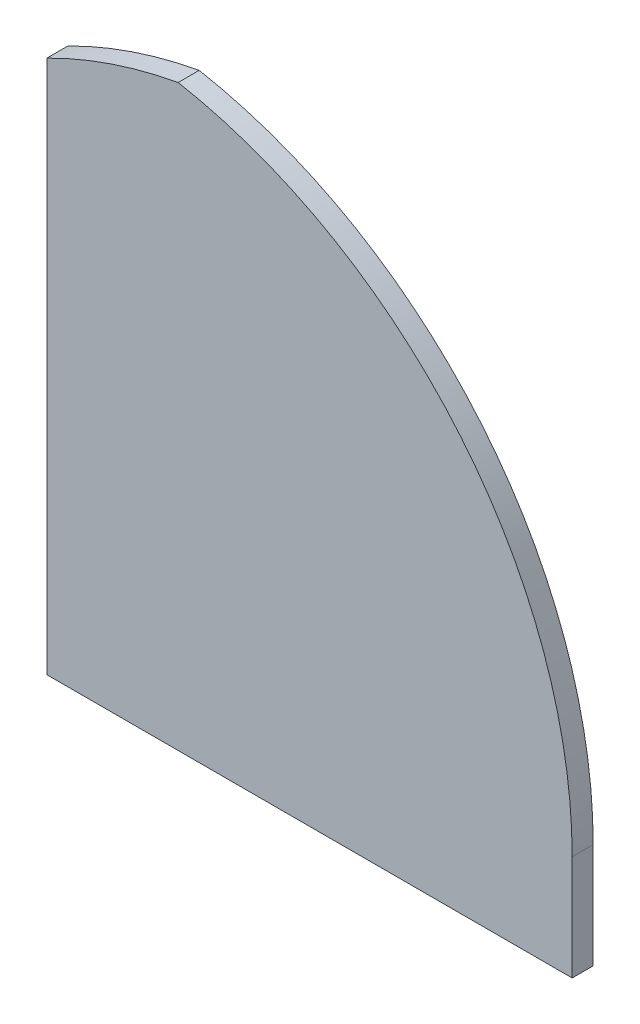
ISO-10303-21;
HEADER;
FILE_DESCRIPTION(('STEP AP214'),'2;1');
FILE_NAME('part.step','',(''),(''),'','','');
FILE_SCHEMA(('AUTOMOTIVE_DESIGN { 1 0 10303 214 1 1 1 1 }'));
ENDSEC;
DATA;
#1=APPLICATION_CONTEXT('core data for automotive mechanical design processes');
#2=APPLICATION_PROTOCOL_DEFINITION('international standard','automotive_design',2000,#1);
#3=PRODUCT_CONTEXT('',#1,'mechanical');
#4=PRODUCT('Part','Part','',(#3));
#5=PRODUCT_RELATED_PRODUCT_CATEGORY('part','',(#4));
#6=PRODUCT_DEFINITION_FORMATION('','',#4);
#7=PRODUCT_DEFINITION_CONTEXT('part definition',#1,'design');
#8=PRODUCT_DEFINITION('design','',#6,#7);
#9=PRODUCT_DEFINITION_SHAPE('','',#8);
#10=(LENGTH_UNIT() NAMED_UNIT(*) SI_UNIT(.MILLI.,.METRE.));
#11=(NAMED_UNIT(*) PLANE_ANGLE_UNIT() SI_UNIT($,.RADIAN.));
#12=(NAMED_UNIT(*) SI_UNIT($,.STERADIAN.) SOLID_ANGLE_UNIT());
#13=UNCERTAINTY_MEASURE_WITH_UNIT(LENGTH_MEASURE(1.E-05),#10,'distance_accuracy_value','');
#14=(GEOMETRIC_REPRESENTATION_CONTEXT(3) GLOBAL_UNCERTAINTY_ASSIGNED_CONTEXT((#13)) GLOBAL_UNIT_ASSIGNED_CONTEXT((#10,
#11,#12)) REPRESENTATION_CONTEXT('',''));
#15=CARTESIAN_POINT('',(0.,0.,0.));
#16=DIRECTION('',(0.,0.,1.));
#17=DIRECTION('',(1.,0.,0.));
#18=AXIS2_PLACEMENT_3D('',#15,#16,#17);
#19=CARTESIAN_POINT('',(1518.29859561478,-491.370616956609,80.));
#20=DIRECTION('',(-1.,0.,0.));
#21=DIRECTION('',(0.,0.,1.));
#22=AXIS2_PLACEMENT_3D('',#19,#20,#21);
#23=PLANE('',#22);
#24=DIRECTION('',(0.,1.,0.));
#25=VECTOR('',#24,1.);
#26=CARTESIAN_POINT('',(1518.29859561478,-491.370616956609,0.));
#27=LINE('',#26,#25);
#28=CARTESIAN_POINT('',(1518.29859561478,-491.370616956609,0.));
#29=VERTEX_POINT('',#28);
#30=CARTESIAN_POINT('',(1518.29859561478,-91.3706169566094,0.));
#31=VERTEX_POINT('',#30);
#32=EDGE_CURVE('E106',#29,#31,#27,.T.);
#33=ORIENTED_EDGE('',*,*,#32,.T.);
#34=DIRECTION('',(0.,0.,-1.));
#35=VECTOR('',#34,1.);
#36=CARTESIAN_POINT('',(1518.29859561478,-91.3706169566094,80.));
#37=LINE('',#36,#35);
#38=CARTESIAN_POINT('',(1518.29859561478,-91.3706169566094,80.));
#39=VERTEX_POINT('',#38);
#40=EDGE_CURVE('E11',#39,#31,#37,.T.);
#41=ORIENTED_EDGE('',*,*,#40,.F.);
#42=DIRECTION('',(0.,1.,0.));
#43=VECTOR('',#42,1.);
#44=CARTESIAN_POINT('',(1518.29859561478,-491.370616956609,80.));
#45=LINE('',#44,#43);
#46=CARTESIAN_POINT('',(1518.29859561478,-491.370616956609,80.));
#47=VERTEX_POINT('',#46);
#48=EDGE_CURVE('E114',#47,#39,#45,.T.);
#49=ORIENTED_EDGE('',*,*,#48,.F.);
#50=DIRECTION('',(0.,0.,-1.));
#51=VECTOR('',#50,1.);
#52=CARTESIAN_POINT('',(1518.29859561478,-491.370616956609,80.));
#53=LINE('',#52,#51);
#54=EDGE_CURVE('E102',#47,#29,#53,.T.);
#55=ORIENTED_EDGE('',*,*,#54,.T.);
#56=EDGE_LOOP('',(#33,#41,#49,#55));
#57=FACE_BOUND('',#56,.T.);
#58=ADVANCED_FACE('F32',(#57),#23,.F.);
#59=CARTESIAN_POINT('',(-314.737925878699,-91.3706169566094,80.));
#60=DIRECTION('',(0.,0.,-1.));
#61=DIRECTION('',(-1.,0.,0.));
#62=AXIS2_PLACEMENT_3D('',#59,#60,#61);
#63=CYLINDRICAL_SURFACE('',#62,1833.03652149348);
#64=CARTESIAN_POINT('',(-314.737925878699,-91.3706169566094,0.));
#65=DIRECTION('',(0.,0.,1.));
#66=DIRECTION('',(1.,0.,0.));
#67=AXIS2_PLACEMENT_3D('',#64,#65,#66);
#68=CIRCLE('',#67,1833.03652149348);
#69=CARTESIAN_POINT('',(18.2985956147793,1711.15804147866,0.));
#70=VERTEX_POINT('',#69);
#71=EDGE_CURVE('E109',#31,#70,#68,.T.);
#72=ORIENTED_EDGE('',*,*,#71,.T.);
#73=DIRECTION('',(0.,0.,-1.));
#74=VECTOR('',#73,1.);
#75=CARTESIAN_POINT('',(18.2985956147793,1711.15804147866,80.));
#76=LINE('',#75,#74);
#77=CARTESIAN_POINT('',(18.2985956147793,1711.15804147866,80.));
#78=VERTEX_POINT('',#77);
#79=EDGE_CURVE('E40',#78,#70,#76,.T.);
#80=ORIENTED_EDGE('',*,*,#79,.F.);
#81=CARTESIAN_POINT('',(-314.737925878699,-91.3706169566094,80.));
#82=DIRECTION('',(0.,0.,1.));
#83=DIRECTION('',(1.,0.,0.));
#84=AXIS2_PLACEMENT_3D('',#81,#82,#83);
#85=CIRCLE('',#84,1833.03652149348);
#86=EDGE_CURVE('E82',#39,#78,#85,.T.);
#87=ORIENTED_EDGE('',*,*,#86,.F.);
#88=ORIENTED_EDGE('',*,*,#40,.T.);
#89=EDGE_LOOP('',(#72,#80,#87,#88));
#90=FACE_BOUND('',#89,.T.);
#91=ADVANCED_FACE('F133',(#90),#63,.T.);
#92=CARTESIAN_POINT('',(351.335117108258,-91.3706169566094,80.));
#93=DIRECTION('',(0.,0.,-1.));
#94=DIRECTION('',(-1.,0.,0.));
#95=AXIS2_PLACEMENT_3D('',#92,#93,#94);
#96=CYLINDRICAL_SURFACE('',#95,1833.03652149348);
#97=CARTESIAN_POINT('',(351.335117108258,-91.3706169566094,0.));
#98=DIRECTION('',(0.,0.,1.));
#99=DIRECTION('',(-1.,0.,0.));
#100=AXIS2_PLACEMENT_3D('',#97,#98,#99);
#101=CIRCLE('',#100,1833.03652149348);
#102=CARTESIAN_POINT('',(-481.70140438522,1541.44077539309,0.));
#103=VERTEX_POINT('',#102);
#104=EDGE_CURVE('E97',#70,#103,#101,.T.);
#105=ORIENTED_EDGE('',*,*,#104,.T.);
#106=DIRECTION('',(0.,0.,-1.));
#107=VECTOR('',#106,1.);
#108=CARTESIAN_POINT('',(-481.70140438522,1541.44077539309,80.));
#109=LINE('',#108,#107);
#110=CARTESIAN_POINT('',(-481.70140438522,1541.44077539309,80.));
#111=VERTEX_POINT('',#110);
#112=EDGE_CURVE('E94',#111,#103,#109,.T.);
#113=ORIENTED_EDGE('',*,*,#112,.F.);
#114=CARTESIAN_POINT('',(351.335117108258,-91.3706169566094,80.));
#115=DIRECTION('',(0.,0.,1.));
#116=DIRECTION('',(-1.,0.,0.));
#117=AXIS2_PLACEMENT_3D('',#114,#115,#116);
#118=CIRCLE('',#117,1833.03652149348);
#119=EDGE_CURVE('E86',#78,#111,#118,.T.);
#120=ORIENTED_EDGE('',*,*,#119,.F.);
#121=ORIENTED_EDGE('',*,*,#79,.T.);
#122=EDGE_LOOP('',(#105,#113,#120,#121));
#123=FACE_BOUND('',#122,.T.);
#124=ADVANCED_FACE('F95',(#123),#96,.T.);
#125=CARTESIAN_POINT('',(-481.701404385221,-491.370616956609,80.));
#126=DIRECTION('',(1.,0.,0.));
#127=DIRECTION('',(0.,1.,0.));
#128=AXIS2_PLACEMENT_3D('',#125,#126,#127);
#129=PLANE('',#128);
#130=DIRECTION('',(0.,-1.,0.));
#131=VECTOR('',#130,1.);
#132=CARTESIAN_POINT('',(-481.701404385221,-491.370616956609,0.));
#133=LINE('',#132,#131);
#134=CARTESIAN_POINT('',(-481.701404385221,-491.370616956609,0.));
#135=VERTEX_POINT('',#134);
#136=EDGE_CURVE('E68',#103,#135,#133,.T.);
#137=ORIENTED_EDGE('',*,*,#136,.T.);
#138=DIRECTION('',(0.,0.,-1.));
#139=VECTOR('',#138,1.);
#140=CARTESIAN_POINT('',(-481.701404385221,-491.370616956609,80.));
#141=LINE('',#140,#139);
#142=CARTESIAN_POINT('',(-481.701404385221,-491.370616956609,80.));
#143=VERTEX_POINT('',#142);
#144=EDGE_CURVE('E98',#143,#135,#141,.T.);
#145=ORIENTED_EDGE('',*,*,#144,.F.);
#146=DIRECTION('',(0.,-1.,0.));
#147=VECTOR('',#146,1.);
#148=CARTESIAN_POINT('',(-481.701404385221,-491.370616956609,80.));
#149=LINE('',#148,#147);
#150=EDGE_CURVE('E90',#111,#143,#149,.T.);
#151=ORIENTED_EDGE('',*,*,#150,.F.);
#152=ORIENTED_EDGE('',*,*,#112,.T.);
#153=EDGE_LOOP('',(#137,#145,#151,#152));
#154=FACE_BOUND('',#153,.T.);
#155=ADVANCED_FACE('F100',(#154),#129,.F.);
#156=CARTESIAN_POINT('',(1518.29859561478,-491.370616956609,80.));
#157=DIRECTION('',(0.,1.,0.));
#158=DIRECTION('',(-1.,0.,0.));
#159=AXIS2_PLACEMENT_3D('',#156,#157,#158);
#160=PLANE('',#159);
#161=DIRECTION('',(1.,0.,0.));
#162=VECTOR('',#161,1.);
#163=CARTESIAN_POINT('',(1518.29859561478,-491.370616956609,0.));
#164=LINE('',#163,#162);
#165=EDGE_CURVE('E74',#135,#29,#164,.T.);
#166=ORIENTED_EDGE('',*,*,#165,.T.);
#167=ORIENTED_EDGE('',*,*,#54,.F.);
#168=DIRECTION('',(1.,0.,0.));
#169=VECTOR('',#168,1.);
#170=CARTESIAN_POINT('',(1518.29859561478,-491.370616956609,80.));
#171=LINE('',#170,#169);
#172=EDGE_CURVE('E48',#143,#47,#171,.T.);
#173=ORIENTED_EDGE('',*,*,#172,.F.);
#174=ORIENTED_EDGE('',*,*,#144,.T.);
#175=EDGE_LOOP('',(#166,#167,#173,#174));
#176=FACE_BOUND('',#175,.T.);
#177=ADVANCED_FACE('F122',(#176),#160,.F.);
#178=CARTESIAN_POINT('',(-314.737925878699,-91.3706169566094,80.));
#179=DIRECTION('',(0.,0.,1.));
#180=DIRECTION('',(1.,0.,0.));
#181=AXIS2_PLACEMENT_3D('',#178,#179,#180);
#182=PLANE('',#181);
#183=ORIENTED_EDGE('',*,*,#48,.T.);
#184=ORIENTED_EDGE('',*,*,#86,.T.);
#185=ORIENTED_EDGE('',*,*,#119,.T.);
#186=ORIENTED_EDGE('',*,*,#150,.T.);
#187=ORIENTED_EDGE('',*,*,#172,.T.);
#188=EDGE_LOOP('',(#183,#184,#185,#186,#187));
#189=FACE_BOUND('',#188,.T.);
#190=ADVANCED_FACE('F88',(#189),#182,.T.);
#191=CARTESIAN_POINT('',(-314.737925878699,-91.3706169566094,0.));
#192=DIRECTION('',(0.,0.,1.));
#193=DIRECTION('',(1.,0.,0.));
#194=AXIS2_PLACEMENT_3D('',#191,#192,#193);
#195=PLANE('',#194);
#196=ORIENTED_EDGE('',*,*,#32,.F.);
#197=ORIENTED_EDGE('',*,*,#165,.F.);
#198=ORIENTED_EDGE('',*,*,#136,.F.);
#199=ORIENTED_EDGE('',*,*,#104,.F.);
#200=ORIENTED_EDGE('',*,*,#71,.F.);
#201=EDGE_LOOP('',(#196,#197,#198,#199,#200));
#202=FACE_BOUND('',#201,.T.);
#203=ADVANCED_FACE('F118',(#202),#195,.F.);
#204=CLOSED_SHELL('',(#58,#91,#124,#155,#177,#190,#203));
#205=MANIFOLD_SOLID_BREP('B2',#204);
#206=ADVANCED_BREP_SHAPE_REPRESENTATION('',(#18,#205),#14);
#207=SHAPE_DEFINITION_REPRESENTATION(#9,#206);
ENDSEC;
END-ISO-10303-21;
